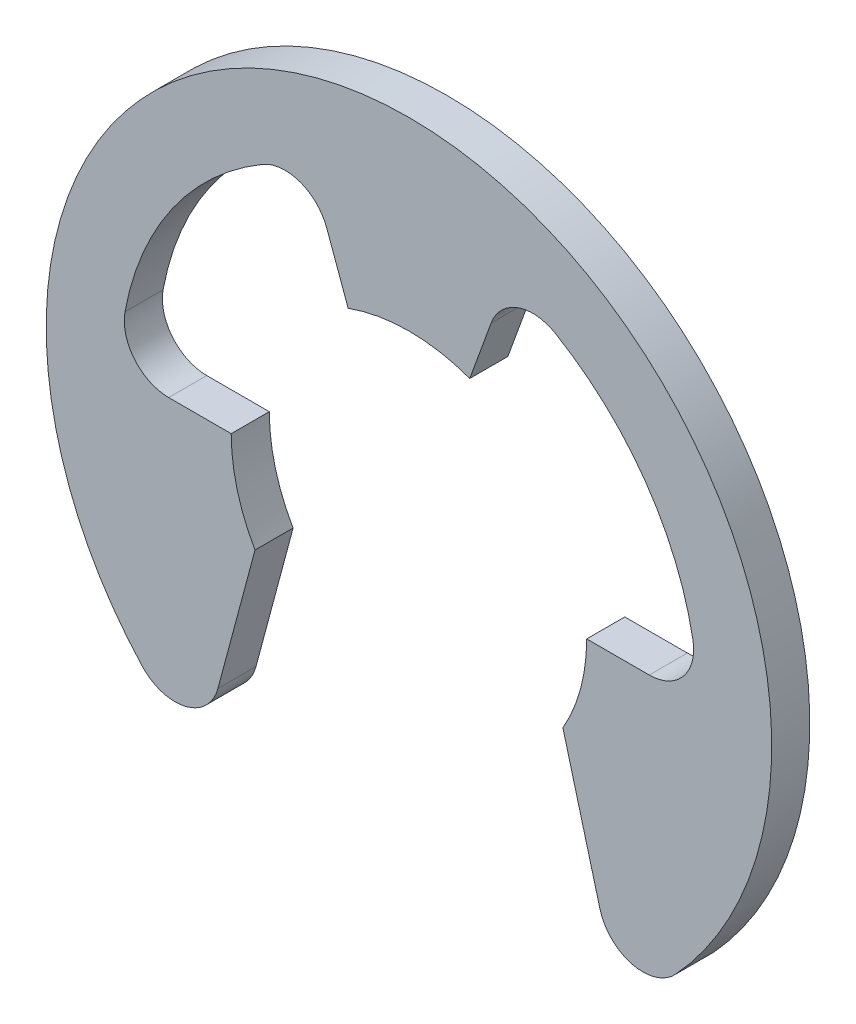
ISO-10303-21;
HEADER;
FILE_DESCRIPTION(('STEP AP214'),'2;1');
FILE_NAME('part.step','',(''),(''),'','','');
FILE_SCHEMA(('AUTOMOTIVE_DESIGN { 1 0 10303 214 1 1 1 1 }'));
ENDSEC;
DATA;
#1=APPLICATION_CONTEXT('core data for automotive mechanical design processes');
#2=APPLICATION_PROTOCOL_DEFINITION('international standard','automotive_design',2000,#1);
#3=PRODUCT_CONTEXT('',#1,'mechanical');
#4=PRODUCT('Part','Part','',(#3));
#5=PRODUCT_RELATED_PRODUCT_CATEGORY('part','',(#4));
#6=PRODUCT_DEFINITION_FORMATION('','',#4);
#7=PRODUCT_DEFINITION_CONTEXT('part definition',#1,'design');
#8=PRODUCT_DEFINITION('design','',#6,#7);
#9=PRODUCT_DEFINITION_SHAPE('','',#8);
#10=(LENGTH_UNIT() NAMED_UNIT(*) SI_UNIT(.MILLI.,.METRE.));
#11=(NAMED_UNIT(*) PLANE_ANGLE_UNIT() SI_UNIT($,.RADIAN.));
#12=(NAMED_UNIT(*) SI_UNIT($,.STERADIAN.) SOLID_ANGLE_UNIT());
#13=UNCERTAINTY_MEASURE_WITH_UNIT(LENGTH_MEASURE(1.E-05),#10,'distance_accuracy_value','');
#14=(GEOMETRIC_REPRESENTATION_CONTEXT(3) GLOBAL_UNCERTAINTY_ASSIGNED_CONTEXT((#13)) GLOBAL_UNIT_ASSIGNED_CONTEXT((#10,
#11,#12)) REPRESENTATION_CONTEXT('',''));
#15=CARTESIAN_POINT('',(0.,0.,0.));
#16=DIRECTION('',(0.,0.,1.));
#17=DIRECTION('',(1.,0.,0.));
#18=AXIS2_PLACEMENT_3D('',#15,#16,#17);
#19=CARTESIAN_POINT('',(0.,0.,-1.0668));
#20=DIRECTION('',(0.,0.,1.));
#21=DIRECTION('',(1.,0.,0.));
#22=AXIS2_PLACEMENT_3D('',#19,#20,#21);
#23=CYLINDRICAL_SURFACE('',#22,4.9784);
#24=CARTESIAN_POINT('',(0.,0.,0.));
#25=DIRECTION('',(0.,0.,-1.));
#26=DIRECTION('',(1.,0.,0.));
#27=AXIS2_PLACEMENT_3D('',#24,#25,#26);
#28=CIRCLE('',#27,4.9784);
#29=CARTESIAN_POINT('',(4.9784,0.,0.));
#30=VERTEX_POINT('',#29);
#31=CARTESIAN_POINT('',(4.31142087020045,-2.48920000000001,0.));
#32=VERTEX_POINT('',#31);
#33=EDGE_CURVE('E198',#30,#32,#28,.T.);
#34=ORIENTED_EDGE('',*,*,#33,.F.);
#35=DIRECTION('',(0.,0.,1.));
#36=VECTOR('',#35,1.);
#37=CARTESIAN_POINT('',(4.9784,0.,-1.0668));
#38=LINE('',#37,#36);
#39=CARTESIAN_POINT('',(4.9784,0.,-1.0668));
#40=VERTEX_POINT('',#39);
#41=EDGE_CURVE('E11',#40,#30,#38,.T.);
#42=ORIENTED_EDGE('',*,*,#41,.F.);
#43=CARTESIAN_POINT('',(0.,0.,-1.0668));
#44=DIRECTION('',(0.,0.,-1.));
#45=DIRECTION('',(1.,0.,0.));
#46=AXIS2_PLACEMENT_3D('',#43,#44,#45);
#47=CIRCLE('',#46,4.9784);
#48=CARTESIAN_POINT('',(4.31142087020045,-2.48920000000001,-1.0668));
#49=VERTEX_POINT('',#48);
#50=EDGE_CURVE('E246',#40,#49,#47,.T.);
#51=ORIENTED_EDGE('',*,*,#50,.T.);
#52=DIRECTION('',(0.,0.,1.));
#53=VECTOR('',#52,1.);
#54=CARTESIAN_POINT('',(4.31142087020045,-2.48920000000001,-1.0668));
#55=LINE('',#54,#53);
#56=EDGE_CURVE('E45',#49,#32,#55,.T.);
#57=ORIENTED_EDGE('',*,*,#56,.T.);
#58=EDGE_LOOP('',(#34,#42,#51,#57));
#59=FACE_BOUND('',#58,.T.);
#60=ADVANCED_FACE('F39',(#59),#23,.F.);
#61=CARTESIAN_POINT('',(4.9784,0.,-1.0668));
#62=DIRECTION('',(0.,1.,0.));
#63=DIRECTION('',(-1.,0.,0.));
#64=AXIS2_PLACEMENT_3D('',#61,#62,#63);
#65=PLANE('',#64);
#66=DIRECTION('',(-1.,0.,0.));
#67=VECTOR('',#66,1.);
#68=CARTESIAN_POINT('',(4.9784,0.,0.));
#69=LINE('',#68,#67);
#70=CARTESIAN_POINT('',(6.7298416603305,0.,0.));
#71=VERTEX_POINT('',#70);
#72=EDGE_CURVE('E242',#71,#30,#69,.T.);
#73=ORIENTED_EDGE('',*,*,#72,.F.);
#74=DIRECTION('',(0.,0.,1.));
#75=VECTOR('',#74,1.);
#76=CARTESIAN_POINT('',(6.7298416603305,0.,-1.0668));
#77=LINE('',#76,#75);
#78=CARTESIAN_POINT('',(6.7298416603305,0.,-1.0668));
#79=VERTEX_POINT('',#78);
#80=EDGE_CURVE('E48',#79,#71,#77,.T.);
#81=ORIENTED_EDGE('',*,*,#80,.F.);
#82=DIRECTION('',(-1.,0.,0.));
#83=VECTOR('',#82,1.);
#84=CARTESIAN_POINT('',(4.9784,0.,-1.0668));
#85=LINE('',#84,#83);
#86=EDGE_CURVE('E187',#79,#40,#85,.T.);
#87=ORIENTED_EDGE('',*,*,#86,.T.);
#88=ORIENTED_EDGE('',*,*,#41,.T.);
#89=EDGE_LOOP('',(#73,#81,#87,#88));
#90=FACE_BOUND('',#89,.T.);
#91=ADVANCED_FACE('F279',(#90),#65,.T.);
#92=CARTESIAN_POINT('',(6.7298416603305,1.243584,-1.0668));
#93=DIRECTION('',(0.,0.,1.));
#94=DIRECTION('',(1.,0.,0.));
#95=AXIS2_PLACEMENT_3D('',#92,#93,#94);
#96=CYLINDRICAL_SURFACE('',#95,1.243584);
#97=CARTESIAN_POINT('',(6.7298416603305,1.243584,0.));
#98=DIRECTION('',(0.,0.,-1.));
#99=DIRECTION('',(1.,0.,0.));
#100=AXIS2_PLACEMENT_3D('',#97,#98,#99);
#101=CIRCLE('',#100,1.243584);
#102=CARTESIAN_POINT('',(7.95272262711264,1.46955591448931,0.));
#103=VERTEX_POINT('',#102);
#104=EDGE_CURVE('E173',#103,#71,#101,.T.);
#105=ORIENTED_EDGE('',*,*,#104,.F.);
#106=DIRECTION('',(0.,0.,1.));
#107=VECTOR('',#106,1.);
#108=CARTESIAN_POINT('',(7.95272262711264,1.46955591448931,-1.0668));
#109=LINE('',#108,#107);
#110=CARTESIAN_POINT('',(7.95272262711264,1.46955591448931,-1.0668));
#111=VERTEX_POINT('',#110);
#112=EDGE_CURVE('E166',#111,#103,#109,.T.);
#113=ORIENTED_EDGE('',*,*,#112,.F.);
#114=CARTESIAN_POINT('',(6.7298416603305,1.243584,-1.0668));
#115=DIRECTION('',(0.,0.,-1.));
#116=DIRECTION('',(1.,0.,0.));
#117=AXIS2_PLACEMENT_3D('',#114,#115,#116);
#118=CIRCLE('',#117,1.243584);
#119=EDGE_CURVE('E171',#111,#79,#118,.T.);
#120=ORIENTED_EDGE('',*,*,#119,.T.);
#121=ORIENTED_EDGE('',*,*,#80,.T.);
#122=EDGE_LOOP('',(#105,#113,#120,#121));
#123=FACE_BOUND('',#122,.T.);
#124=ADVANCED_FACE('F167',(#123),#96,.F.);
#125=CARTESIAN_POINT('',(0.,0.,-1.0668));
#126=DIRECTION('',(0.,0.,1.));
#127=DIRECTION('',(1.,0.,0.));
#128=AXIS2_PLACEMENT_3D('',#125,#126,#127);
#129=CYLINDRICAL_SURFACE('',#128,8.08736);
#130=CARTESIAN_POINT('',(0.,0.,0.));
#131=DIRECTION('',(0.,0.,-1.));
#132=DIRECTION('',(1.,0.,0.));
#133=AXIS2_PLACEMENT_3D('',#130,#131,#132);
#134=CIRCLE('',#133,8.08736);
#135=CARTESIAN_POINT('',(4.10092218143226,6.97049704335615,0.));
#136=VERTEX_POINT('',#135);
#137=EDGE_CURVE('E241',#136,#103,#134,.T.);
#138=ORIENTED_EDGE('',*,*,#137,.F.);
#139=DIRECTION('',(0.,0.,1.));
#140=VECTOR('',#139,1.);
#141=CARTESIAN_POINT('',(4.10092218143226,6.97049704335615,-1.0668));
#142=LINE('',#141,#140);
#143=CARTESIAN_POINT('',(4.10092218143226,6.97049704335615,-1.0668));
#144=VERTEX_POINT('',#143);
#145=EDGE_CURVE('E178',#144,#136,#142,.T.);
#146=ORIENTED_EDGE('',*,*,#145,.F.);
#147=CARTESIAN_POINT('',(0.,0.,-1.0668));
#148=DIRECTION('',(0.,0.,-1.));
#149=DIRECTION('',(1.,0.,0.));
#150=AXIS2_PLACEMENT_3D('',#147,#148,#149);
#151=CIRCLE('',#150,8.08736);
#152=EDGE_CURVE('E183',#144,#111,#151,.T.);
#153=ORIENTED_EDGE('',*,*,#152,.T.);
#154=ORIENTED_EDGE('',*,*,#112,.T.);
#155=EDGE_LOOP('',(#138,#146,#153,#154));
#156=FACE_BOUND('',#155,.T.);
#157=ADVANCED_FACE('F189',(#156),#129,.F.);
#158=CARTESIAN_POINT('',(3.47032811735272,5.89865176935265,-1.0668));
#159=DIRECTION('',(0.,0.,1.));
#160=DIRECTION('',(1.,0.,0.));
#161=AXIS2_PLACEMENT_3D('',#158,#159,#160);
#162=CYLINDRICAL_SURFACE('',#161,1.243584);
#163=CARTESIAN_POINT('',(3.47032811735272,5.89865176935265,0.));
#164=DIRECTION('',(0.,0.,-1.));
#165=DIRECTION('',(-1.,0.,0.));
#166=AXIS2_PLACEMENT_3D('',#163,#164,#165);
#167=CIRCLE('',#166,1.243584);
#168=CARTESIAN_POINT('',(2.3017414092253,6.32398254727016,0.));
#169=VERTEX_POINT('',#168);
#170=EDGE_CURVE('E238',#169,#136,#167,.T.);
#171=ORIENTED_EDGE('',*,*,#170,.F.);
#172=DIRECTION('',(0.,0.,1.));
#173=VECTOR('',#172,1.);
#174=CARTESIAN_POINT('',(2.3017414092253,6.32398254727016,-1.0668));
#175=LINE('',#174,#173);
#176=CARTESIAN_POINT('',(2.3017414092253,6.32398254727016,-1.0668));
#177=VERTEX_POINT('',#176);
#178=EDGE_CURVE('E249',#177,#169,#175,.T.);
#179=ORIENTED_EDGE('',*,*,#178,.F.);
#180=CARTESIAN_POINT('',(3.47032811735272,5.89865176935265,-1.0668));
#181=DIRECTION('',(0.,0.,-1.));
#182=DIRECTION('',(-1.,0.,0.));
#183=AXIS2_PLACEMENT_3D('',#180,#181,#182);
#184=CIRCLE('',#183,1.243584);
#185=EDGE_CURVE('E186',#177,#144,#184,.T.);
#186=ORIENTED_EDGE('',*,*,#185,.T.);
#187=ORIENTED_EDGE('',*,*,#145,.T.);
#188=EDGE_LOOP('',(#171,#179,#186,#187));
#189=FACE_BOUND('',#188,.T.);
#190=ADVANCED_FACE('F293',(#189),#162,.F.);
#191=CARTESIAN_POINT('',(1.70271308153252,4.67816574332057,-1.0668));
#192=DIRECTION('',(0.939692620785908,-0.34202014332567,0.));
#193=DIRECTION('',(0.34202014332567,0.939692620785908,0.));
#194=AXIS2_PLACEMENT_3D('',#191,#192,#193);
#195=PLANE('',#194);
#196=DIRECTION('',(0.34202014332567,0.939692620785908,0.));
#197=VECTOR('',#196,1.);
#198=CARTESIAN_POINT('',(1.70271308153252,4.67816574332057,0.));
#199=LINE('',#198,#197);
#200=CARTESIAN_POINT('',(1.70271308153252,4.67816574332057,0.));
#201=VERTEX_POINT('',#200);
#202=EDGE_CURVE('E232',#201,#169,#199,.T.);
#203=ORIENTED_EDGE('',*,*,#202,.F.);
#204=DIRECTION('',(0.,0.,1.));
#205=VECTOR('',#204,1.);
#206=CARTESIAN_POINT('',(1.70271308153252,4.67816574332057,-1.0668));
#207=LINE('',#206,#205);
#208=CARTESIAN_POINT('',(1.70271308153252,4.67816574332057,-1.0668));
#209=VERTEX_POINT('',#208);
#210=EDGE_CURVE('E255',#209,#201,#207,.T.);
#211=ORIENTED_EDGE('',*,*,#210,.F.);
#212=DIRECTION('',(0.34202014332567,0.939692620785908,0.));
#213=VECTOR('',#212,1.);
#214=CARTESIAN_POINT('',(1.70271308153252,4.67816574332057,-1.0668));
#215=LINE('',#214,#213);
#216=EDGE_CURVE('E192',#209,#177,#215,.T.);
#217=ORIENTED_EDGE('',*,*,#216,.T.);
#218=ORIENTED_EDGE('',*,*,#178,.T.);
#219=EDGE_LOOP('',(#203,#211,#217,#218));
#220=FACE_BOUND('',#219,.T.);
#221=ADVANCED_FACE('F295',(#220),#195,.T.);
#222=CARTESIAN_POINT('',(0.,0.,-1.0668));
#223=DIRECTION('',(0.,0.,1.));
#224=DIRECTION('',(1.,0.,0.));
#225=AXIS2_PLACEMENT_3D('',#222,#223,#224);
#226=CYLINDRICAL_SURFACE('',#225,4.9784);
#227=CARTESIAN_POINT('',(0.,0.,0.));
#228=DIRECTION('',(0.,0.,-1.));
#229=DIRECTION('',(1.,0.,0.));
#230=AXIS2_PLACEMENT_3D('',#227,#228,#229);
#231=CIRCLE('',#230,4.9784);
#232=CARTESIAN_POINT('',(-1.70271308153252,4.67816574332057,0.));
#233=VERTEX_POINT('',#232);
#234=EDGE_CURVE('E235',#233,#201,#231,.T.);
#235=ORIENTED_EDGE('',*,*,#234,.F.);
#236=DIRECTION('',(0.,0.,1.));
#237=VECTOR('',#236,1.);
#238=CARTESIAN_POINT('',(-1.70271308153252,4.67816574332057,-1.0668));
#239=LINE('',#238,#237);
#240=CARTESIAN_POINT('',(-1.70271308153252,4.67816574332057,-1.0668));
#241=VERTEX_POINT('',#240);
#242=EDGE_CURVE('E251',#241,#233,#239,.T.);
#243=ORIENTED_EDGE('',*,*,#242,.F.);
#244=CARTESIAN_POINT('',(0.,0.,-1.0668));
#245=DIRECTION('',(0.,0.,-1.));
#246=DIRECTION('',(1.,0.,0.));
#247=AXIS2_PLACEMENT_3D('',#244,#245,#246);
#248=CIRCLE('',#247,4.9784);
#249=EDGE_CURVE('E505',#241,#209,#248,.T.);
#250=ORIENTED_EDGE('',*,*,#249,.T.);
#251=ORIENTED_EDGE('',*,*,#210,.T.);
#252=EDGE_LOOP('',(#235,#243,#250,#251));
#253=FACE_BOUND('',#252,.T.);
#254=ADVANCED_FACE('F296',(#253),#226,.F.);
#255=CARTESIAN_POINT('',(-1.70271308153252,4.67816574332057,-1.0668));
#256=DIRECTION('',(-0.939692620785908,-0.34202014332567,0.));
#257=DIRECTION('',(0.34202014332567,-0.939692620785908,0.));
#258=AXIS2_PLACEMENT_3D('',#255,#256,#257);
#259=PLANE('',#258);
#260=DIRECTION('',(0.34202014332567,-0.939692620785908,0.));
#261=VECTOR('',#260,1.);
#262=CARTESIAN_POINT('',(-1.70271308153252,4.67816574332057,0.));
#263=LINE('',#262,#261);
#264=CARTESIAN_POINT('',(-2.3017414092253,6.32398254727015,0.));
#265=VERTEX_POINT('',#264);
#266=EDGE_CURVE('E230',#265,#233,#263,.T.);
#267=ORIENTED_EDGE('',*,*,#266,.F.);
#268=DIRECTION('',(0.,0.,1.));
#269=VECTOR('',#268,1.);
#270=CARTESIAN_POINT('',(-2.3017414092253,6.32398254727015,-1.0668));
#271=LINE('',#270,#269);
#272=CARTESIAN_POINT('',(-2.3017414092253,6.32398254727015,-1.0668));
#273=VERTEX_POINT('',#272);
#274=EDGE_CURVE('E257',#273,#265,#271,.T.);
#275=ORIENTED_EDGE('',*,*,#274,.F.);
#276=DIRECTION('',(0.34202014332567,-0.939692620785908,0.));
#277=VECTOR('',#276,1.);
#278=CARTESIAN_POINT('',(-1.70271308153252,4.67816574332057,-1.0668));
#279=LINE('',#278,#277);
#280=EDGE_CURVE('E506',#273,#241,#279,.T.);
#281=ORIENTED_EDGE('',*,*,#280,.T.);
#282=ORIENTED_EDGE('',*,*,#242,.T.);
#283=EDGE_LOOP('',(#267,#275,#281,#282));
#284=FACE_BOUND('',#283,.T.);
#285=ADVANCED_FACE('F305',(#284),#259,.T.);
#286=CARTESIAN_POINT('',(-3.47032811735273,5.89865176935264,-1.0668));
#287=DIRECTION('',(0.,0.,1.));
#288=DIRECTION('',(1.,0.,0.));
#289=AXIS2_PLACEMENT_3D('',#286,#287,#288);
#290=CYLINDRICAL_SURFACE('',#289,1.243584);
#291=CARTESIAN_POINT('',(-3.47032811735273,5.89865176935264,0.));
#292=DIRECTION('',(0.,0.,-1.));
#293=DIRECTION('',(1.,0.,0.));
#294=AXIS2_PLACEMENT_3D('',#291,#292,#293);
#295=CIRCLE('',#294,1.243584);
#296=CARTESIAN_POINT('',(-4.10092218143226,6.97049704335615,0.));
#297=VERTEX_POINT('',#296);
#298=EDGE_CURVE('E228',#297,#265,#295,.T.);
#299=ORIENTED_EDGE('',*,*,#298,.F.);
#300=DIRECTION('',(0.,0.,1.));
#301=VECTOR('',#300,1.);
#302=CARTESIAN_POINT('',(-4.10092218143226,6.97049704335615,-1.0668));
#303=LINE('',#302,#301);
#304=CARTESIAN_POINT('',(-4.10092218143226,6.97049704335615,-1.0668));
#305=VERTEX_POINT('',#304);
#306=EDGE_CURVE('E259',#305,#297,#303,.T.);
#307=ORIENTED_EDGE('',*,*,#306,.F.);
#308=CARTESIAN_POINT('',(-3.47032811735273,5.89865176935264,-1.0668));
#309=DIRECTION('',(0.,0.,-1.));
#310=DIRECTION('',(1.,0.,0.));
#311=AXIS2_PLACEMENT_3D('',#308,#309,#310);
#312=CIRCLE('',#311,1.243584);
#313=EDGE_CURVE('E492',#305,#273,#312,.T.);
#314=ORIENTED_EDGE('',*,*,#313,.T.);
#315=ORIENTED_EDGE('',*,*,#274,.T.);
#316=EDGE_LOOP('',(#299,#307,#314,#315));
#317=FACE_BOUND('',#316,.T.);
#318=ADVANCED_FACE('F306',(#317),#290,.F.);
#319=CARTESIAN_POINT('',(0.,0.,-1.0668));
#320=DIRECTION('',(0.,0.,1.));
#321=DIRECTION('',(1.,0.,0.));
#322=AXIS2_PLACEMENT_3D('',#319,#320,#321);
#323=CYLINDRICAL_SURFACE('',#322,8.08736);
#324=CARTESIAN_POINT('',(0.,0.,0.));
#325=DIRECTION('',(0.,0.,-1.));
#326=DIRECTION('',(1.,0.,0.));
#327=AXIS2_PLACEMENT_3D('',#324,#325,#326);
#328=CIRCLE('',#327,8.08736);
#329=CARTESIAN_POINT('',(-7.95272262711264,1.46955591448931,0.));
#330=VERTEX_POINT('',#329);
#331=EDGE_CURVE('E221',#330,#297,#328,.T.);
#332=ORIENTED_EDGE('',*,*,#331,.F.);
#333=DIRECTION('',(0.,0.,1.));
#334=VECTOR('',#333,1.);
#335=CARTESIAN_POINT('',(-7.95272262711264,1.46955591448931,-1.0668));
#336=LINE('',#335,#334);
#337=CARTESIAN_POINT('',(-7.95272262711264,1.46955591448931,-1.0668));
#338=VERTEX_POINT('',#337);
#339=EDGE_CURVE('E258',#338,#330,#336,.T.);
#340=ORIENTED_EDGE('',*,*,#339,.F.);
#341=CARTESIAN_POINT('',(0.,0.,-1.0668));
#342=DIRECTION('',(0.,0.,-1.));
#343=DIRECTION('',(1.,0.,0.));
#344=AXIS2_PLACEMENT_3D('',#341,#342,#343);
#345=CIRCLE('',#344,8.08736);
#346=EDGE_CURVE('E493',#338,#305,#345,.T.);
#347=ORIENTED_EDGE('',*,*,#346,.T.);
#348=ORIENTED_EDGE('',*,*,#306,.T.);
#349=EDGE_LOOP('',(#332,#340,#347,#348));
#350=FACE_BOUND('',#349,.T.);
#351=ADVANCED_FACE('F309',(#350),#323,.F.);
#352=CARTESIAN_POINT('',(-6.7298416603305,1.243584,-1.0668));
#353=DIRECTION('',(0.,0.,1.));
#354=DIRECTION('',(1.,0.,0.));
#355=AXIS2_PLACEMENT_3D('',#352,#353,#354);
#356=CYLINDRICAL_SURFACE('',#355,1.243584);
#357=CARTESIAN_POINT('',(-6.7298416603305,1.243584,0.));
#358=DIRECTION('',(0.,0.,-1.));
#359=DIRECTION('',(-1.,0.,0.));
#360=AXIS2_PLACEMENT_3D('',#357,#358,#359);
#361=CIRCLE('',#360,1.243584);
#362=CARTESIAN_POINT('',(-6.7298416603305,0.,0.));
#363=VERTEX_POINT('',#362);
#364=EDGE_CURVE('E216',#363,#330,#361,.T.);
#365=ORIENTED_EDGE('',*,*,#364,.F.);
#366=DIRECTION('',(0.,0.,1.));
#367=VECTOR('',#366,1.);
#368=CARTESIAN_POINT('',(-6.7298416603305,0.,-1.0668));
#369=LINE('',#368,#367);
#370=CARTESIAN_POINT('',(-6.7298416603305,0.,-1.0668));
#371=VERTEX_POINT('',#370);
#372=EDGE_CURVE('E264',#371,#363,#369,.T.);
#373=ORIENTED_EDGE('',*,*,#372,.F.);
#374=CARTESIAN_POINT('',(-6.7298416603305,1.243584,-1.0668));
#375=DIRECTION('',(0.,0.,-1.));
#376=DIRECTION('',(-1.,0.,0.));
#377=AXIS2_PLACEMENT_3D('',#374,#375,#376);
#378=CIRCLE('',#377,1.243584);
#379=EDGE_CURVE('E515',#371,#338,#378,.T.);
#380=ORIENTED_EDGE('',*,*,#379,.T.);
#381=ORIENTED_EDGE('',*,*,#339,.T.);
#382=EDGE_LOOP('',(#365,#373,#380,#381));
#383=FACE_BOUND('',#382,.T.);
#384=ADVANCED_FACE('F313',(#383),#356,.F.);
#385=CARTESIAN_POINT('',(-4.9784,0.,-1.0668));
#386=DIRECTION('',(0.,1.,0.));
#387=DIRECTION('',(-1.,0.,0.));
#388=AXIS2_PLACEMENT_3D('',#385,#386,#387);
#389=PLANE('',#388);
#390=DIRECTION('',(-1.,0.,0.));
#391=VECTOR('',#390,1.);
#392=CARTESIAN_POINT('',(-4.9784,0.,0.));
#393=LINE('',#392,#391);
#394=CARTESIAN_POINT('',(-4.9784,0.,0.));
#395=VERTEX_POINT('',#394);
#396=EDGE_CURVE('E219',#395,#363,#393,.T.);
#397=ORIENTED_EDGE('',*,*,#396,.F.);
#398=DIRECTION('',(0.,0.,1.));
#399=VECTOR('',#398,1.);
#400=CARTESIAN_POINT('',(-4.9784,0.,-1.0668));
#401=LINE('',#400,#399);
#402=CARTESIAN_POINT('',(-4.9784,0.,-1.0668));
#403=VERTEX_POINT('',#402);
#404=EDGE_CURVE('E265',#403,#395,#401,.T.);
#405=ORIENTED_EDGE('',*,*,#404,.F.);
#406=DIRECTION('',(-1.,0.,0.));
#407=VECTOR('',#406,1.);
#408=CARTESIAN_POINT('',(-4.9784,0.,-1.0668));
#409=LINE('',#408,#407);
#410=EDGE_CURVE('E484',#403,#371,#409,.T.);
#411=ORIENTED_EDGE('',*,*,#410,.T.);
#412=ORIENTED_EDGE('',*,*,#372,.T.);
#413=EDGE_LOOP('',(#397,#405,#411,#412));
#414=FACE_BOUND('',#413,.T.);
#415=ADVANCED_FACE('F319',(#414),#389,.T.);
#416=CARTESIAN_POINT('',(0.,0.,-1.0668));
#417=DIRECTION('',(0.,0.,1.));
#418=DIRECTION('',(1.,0.,0.));
#419=AXIS2_PLACEMENT_3D('',#416,#417,#418);
#420=CYLINDRICAL_SURFACE('',#419,4.9784);
#421=CARTESIAN_POINT('',(0.,0.,0.));
#422=DIRECTION('',(0.,0.,-1.));
#423=DIRECTION('',(1.,0.,0.));
#424=AXIS2_PLACEMENT_3D('',#421,#422,#423);
#425=CIRCLE('',#424,4.9784);
#426=CARTESIAN_POINT('',(-4.31142087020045,-2.4892,0.));
#427=VERTEX_POINT('',#426);
#428=EDGE_CURVE('E211',#427,#395,#425,.T.);
#429=ORIENTED_EDGE('',*,*,#428,.F.);
#430=DIRECTION('',(0.,0.,1.));
#431=VECTOR('',#430,1.);
#432=CARTESIAN_POINT('',(-4.31142087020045,-2.4892,-1.0668));
#433=LINE('',#432,#431);
#434=CARTESIAN_POINT('',(-4.31142087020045,-2.4892,-1.0668));
#435=VERTEX_POINT('',#434);
#436=EDGE_CURVE('E268',#435,#427,#433,.T.);
#437=ORIENTED_EDGE('',*,*,#436,.F.);
#438=CARTESIAN_POINT('',(0.,0.,-1.0668));
#439=DIRECTION('',(0.,0.,-1.));
#440=DIRECTION('',(1.,0.,0.));
#441=AXIS2_PLACEMENT_3D('',#438,#439,#440);
#442=CIRCLE('',#441,4.9784);
#443=EDGE_CURVE('E476',#435,#403,#442,.T.);
#444=ORIENTED_EDGE('',*,*,#443,.T.);
#445=ORIENTED_EDGE('',*,*,#404,.T.);
#446=EDGE_LOOP('',(#429,#437,#444,#445));
#447=FACE_BOUND('',#446,.T.);
#448=ADVANCED_FACE('F325',(#447),#420,.F.);
#449=CARTESIAN_POINT('',(-4.31142087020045,-2.48920000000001,-1.0668));
#450=DIRECTION('',(0.965925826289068,-0.258819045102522,0.));
#451=DIRECTION('',(0.258819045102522,0.965925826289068,0.));
#452=AXIS2_PLACEMENT_3D('',#449,#450,#451);
#453=PLANE('',#452);
#454=DIRECTION('',(0.258819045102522,0.965925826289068,0.));
#455=VECTOR('',#454,1.);
#456=CARTESIAN_POINT('',(-4.31142087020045,-2.48920000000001,0.));
#457=LINE('',#456,#455);
#458=CARTESIAN_POINT('',(-5.3510620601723,-6.36919374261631,0.));
#459=VERTEX_POINT('',#458);
#460=EDGE_CURVE('E212',#459,#427,#457,.T.);
#461=ORIENTED_EDGE('',*,*,#460,.F.);
#462=DIRECTION('',(0.,0.,1.));
#463=VECTOR('',#462,1.);
#464=CARTESIAN_POINT('',(-5.3510620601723,-6.36919374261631,-1.0668));
#465=LINE('',#464,#463);
#466=CARTESIAN_POINT('',(-5.3510620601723,-6.36919374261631,-1.0668));
#467=VERTEX_POINT('',#466);
#468=EDGE_CURVE('E266',#467,#459,#465,.T.);
#469=ORIENTED_EDGE('',*,*,#468,.F.);
#470=DIRECTION('',(0.258819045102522,0.965925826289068,0.));
#471=VECTOR('',#470,1.);
#472=CARTESIAN_POINT('',(-4.31142087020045,-2.48920000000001,-1.0668));
#473=LINE('',#472,#471);
#474=EDGE_CURVE('E517',#467,#435,#473,.T.);
#475=ORIENTED_EDGE('',*,*,#474,.T.);
#476=ORIENTED_EDGE('',*,*,#436,.T.);
#477=EDGE_LOOP('',(#461,#469,#475,#476));
#478=FACE_BOUND('',#477,.T.);
#479=ADVANCED_FACE('F328',(#478),#453,.T.);
#480=CARTESIAN_POINT('',(-6.55227196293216,-6.04733051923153,-1.0668));
#481=DIRECTION('',(0.,0.,1.));
#482=DIRECTION('',(1.,0.,0.));
#483=AXIS2_PLACEMENT_3D('',#480,#481,#482);
#484=CYLINDRICAL_SURFACE('',#483,1.243584);
#485=CARTESIAN_POINT('',(-6.55227196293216,-6.04733051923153,0.));
#486=DIRECTION('',(0.,0.,1.));
#487=DIRECTION('',(-1.,0.,0.));
#488=AXIS2_PLACEMENT_3D('',#485,#486,#487);
#489=CIRCLE('',#488,1.243584);
#490=CARTESIAN_POINT('',(-7.46612575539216,-6.89075947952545,0.));
#491=VERTEX_POINT('',#490);
#492=EDGE_CURVE('E206',#491,#459,#489,.T.);
#493=ORIENTED_EDGE('',*,*,#492,.F.);
#494=DIRECTION('',(0.,0.,1.));
#495=VECTOR('',#494,1.);
#496=CARTESIAN_POINT('',(-7.46612575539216,-6.89075947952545,-1.0668));
#497=LINE('',#496,#495);
#498=CARTESIAN_POINT('',(-7.46612575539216,-6.89075947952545,-1.0668));
#499=VERTEX_POINT('',#498);
#500=EDGE_CURVE('E267',#499,#491,#497,.T.);
#501=ORIENTED_EDGE('',*,*,#500,.F.);
#502=CARTESIAN_POINT('',(-6.55227196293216,-6.04733051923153,-1.0668));
#503=DIRECTION('',(0.,0.,1.));
#504=DIRECTION('',(-1.,0.,0.));
#505=AXIS2_PLACEMENT_3D('',#502,#503,#504);
#506=CIRCLE('',#505,1.243584);
#507=EDGE_CURVE('E474',#499,#467,#506,.T.);
#508=ORIENTED_EDGE('',*,*,#507,.T.);
#509=ORIENTED_EDGE('',*,*,#468,.T.);
#510=EDGE_LOOP('',(#493,#501,#508,#509));
#511=FACE_BOUND('',#510,.T.);
#512=ADVANCED_FACE('F326',(#511),#484,.T.);
#513=CARTESIAN_POINT('',(0.,0.,-1.0668));
#514=DIRECTION('',(0.,0.,1.));
#515=DIRECTION('',(1.,0.,0.));
#516=AXIS2_PLACEMENT_3D('',#513,#514,#515);
#517=CYLINDRICAL_SURFACE('',#516,10.16);
#518=CARTESIAN_POINT('',(0.,0.,0.));
#519=DIRECTION('',(0.,0.,1.));
#520=DIRECTION('',(1.,0.,0.));
#521=AXIS2_PLACEMENT_3D('',#518,#519,#520);
#522=CIRCLE('',#521,10.16);
#523=CARTESIAN_POINT('',(7.46612575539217,-6.89075947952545,0.));
#524=VERTEX_POINT('',#523);
#525=EDGE_CURVE('E202',#524,#491,#522,.T.);
#526=ORIENTED_EDGE('',*,*,#525,.F.);
#527=DIRECTION('',(0.,0.,1.));
#528=VECTOR('',#527,1.);
#529=CARTESIAN_POINT('',(7.46612575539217,-6.89075947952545,-1.0668));
#530=LINE('',#529,#528);
#531=CARTESIAN_POINT('',(7.46612575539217,-6.89075947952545,-1.0668));
#532=VERTEX_POINT('',#531);
#533=EDGE_CURVE('E275',#532,#524,#530,.T.);
#534=ORIENTED_EDGE('',*,*,#533,.F.);
#535=CARTESIAN_POINT('',(0.,0.,-1.0668));
#536=DIRECTION('',(0.,0.,1.));
#537=DIRECTION('',(1.,0.,0.));
#538=AXIS2_PLACEMENT_3D('',#535,#536,#537);
#539=CIRCLE('',#538,10.16);
#540=EDGE_CURVE('E469',#532,#499,#539,.T.);
#541=ORIENTED_EDGE('',*,*,#540,.T.);
#542=ORIENTED_EDGE('',*,*,#500,.T.);
#543=EDGE_LOOP('',(#526,#534,#541,#542));
#544=FACE_BOUND('',#543,.T.);
#545=ADVANCED_FACE('F334',(#544),#517,.T.);
#546=CARTESIAN_POINT('',(6.55227196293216,-6.04733051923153,-1.0668));
#547=DIRECTION('',(0.,0.,1.));
#548=DIRECTION('',(1.,0.,0.));
#549=AXIS2_PLACEMENT_3D('',#546,#547,#548);
#550=CYLINDRICAL_SURFACE('',#549,1.243584);
#551=CARTESIAN_POINT('',(6.55227196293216,-6.04733051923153,0.));
#552=DIRECTION('',(0.,0.,1.));
#553=DIRECTION('',(1.,0.,0.));
#554=AXIS2_PLACEMENT_3D('',#551,#552,#553);
#555=CIRCLE('',#554,1.243584);
#556=CARTESIAN_POINT('',(5.3510620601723,-6.3691937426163,0.));
#557=VERTEX_POINT('',#556);
#558=EDGE_CURVE('E205',#557,#524,#555,.T.);
#559=ORIENTED_EDGE('',*,*,#558,.F.);
#560=DIRECTION('',(0.,0.,1.));
#561=VECTOR('',#560,1.);
#562=CARTESIAN_POINT('',(5.3510620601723,-6.3691937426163,-1.0668));
#563=LINE('',#562,#561);
#564=CARTESIAN_POINT('',(5.3510620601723,-6.3691937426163,-1.0668));
#565=VERTEX_POINT('',#564);
#566=EDGE_CURVE('E271',#565,#557,#563,.T.);
#567=ORIENTED_EDGE('',*,*,#566,.F.);
#568=CARTESIAN_POINT('',(6.55227196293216,-6.04733051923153,-1.0668));
#569=DIRECTION('',(0.,0.,1.));
#570=DIRECTION('',(1.,0.,0.));
#571=AXIS2_PLACEMENT_3D('',#568,#569,#570);
#572=CIRCLE('',#571,1.243584);
#573=EDGE_CURVE('E518',#565,#532,#572,.T.);
#574=ORIENTED_EDGE('',*,*,#573,.T.);
#575=ORIENTED_EDGE('',*,*,#533,.T.);
#576=EDGE_LOOP('',(#559,#567,#574,#575));
#577=FACE_BOUND('',#576,.T.);
#578=ADVANCED_FACE('F336',(#577),#550,.T.);
#579=CARTESIAN_POINT('',(4.31142087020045,-2.48920000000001,-1.0668));
#580=DIRECTION('',(-0.965925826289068,-0.258819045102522,0.));
#581=DIRECTION('',(0.258819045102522,-0.965925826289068,0.));
#582=AXIS2_PLACEMENT_3D('',#579,#580,#581);
#583=PLANE('',#582);
#584=DIRECTION('',(0.258819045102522,-0.965925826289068,0.));
#585=VECTOR('',#584,1.);
#586=CARTESIAN_POINT('',(4.31142087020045,-2.48920000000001,0.));
#587=LINE('',#586,#585);
#588=EDGE_CURVE('E200',#32,#557,#587,.T.);
#589=ORIENTED_EDGE('',*,*,#588,.F.);
#590=ORIENTED_EDGE('',*,*,#56,.F.);
#591=DIRECTION('',(0.258819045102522,-0.965925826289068,0.));
#592=VECTOR('',#591,1.);
#593=CARTESIAN_POINT('',(4.31142087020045,-2.48920000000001,-1.0668));
#594=LINE('',#593,#592);
#595=EDGE_CURVE('E524',#49,#565,#594,.T.);
#596=ORIENTED_EDGE('',*,*,#595,.T.);
#597=ORIENTED_EDGE('',*,*,#566,.T.);
#598=EDGE_LOOP('',(#589,#590,#596,#597));
#599=FACE_BOUND('',#598,.T.);
#600=ADVANCED_FACE('F273',(#599),#583,.T.);
#601=CARTESIAN_POINT('',(0.,0.,-1.0668));
#602=DIRECTION('',(0.,0.,1.));
#603=DIRECTION('',(1.,0.,0.));
#604=AXIS2_PLACEMENT_3D('',#601,#602,#603);
#605=PLANE('',#604);
#606=ORIENTED_EDGE('',*,*,#50,.F.);
#607=ORIENTED_EDGE('',*,*,#86,.F.);
#608=ORIENTED_EDGE('',*,*,#119,.F.);
#609=ORIENTED_EDGE('',*,*,#152,.F.);
#610=ORIENTED_EDGE('',*,*,#185,.F.);
#611=ORIENTED_EDGE('',*,*,#216,.F.);
#612=ORIENTED_EDGE('',*,*,#249,.F.);
#613=ORIENTED_EDGE('',*,*,#280,.F.);
#614=ORIENTED_EDGE('',*,*,#313,.F.);
#615=ORIENTED_EDGE('',*,*,#346,.F.);
#616=ORIENTED_EDGE('',*,*,#379,.F.);
#617=ORIENTED_EDGE('',*,*,#410,.F.);
#618=ORIENTED_EDGE('',*,*,#443,.F.);
#619=ORIENTED_EDGE('',*,*,#474,.F.);
#620=ORIENTED_EDGE('',*,*,#507,.F.);
#621=ORIENTED_EDGE('',*,*,#540,.F.);
#622=ORIENTED_EDGE('',*,*,#573,.F.);
#623=ORIENTED_EDGE('',*,*,#595,.F.);
#624=EDGE_LOOP('',(#606,#607,#608,#609,#610,#611,#612,#613,#614,#615,#616,#617,#618,#619,#620,
#621,#622,#623));
#625=FACE_BOUND('',#624,.T.);
#626=ADVANCED_FACE('F185',(#625),#605,.F.);
#627=CARTESIAN_POINT('',(0.,0.,0.));
#628=DIRECTION('',(0.,0.,1.));
#629=DIRECTION('',(1.,0.,0.));
#630=AXIS2_PLACEMENT_3D('',#627,#628,#629);
#631=PLANE('',#630);
#632=ORIENTED_EDGE('',*,*,#33,.T.);
#633=ORIENTED_EDGE('',*,*,#588,.T.);
#634=ORIENTED_EDGE('',*,*,#558,.T.);
#635=ORIENTED_EDGE('',*,*,#525,.T.);
#636=ORIENTED_EDGE('',*,*,#492,.T.);
#637=ORIENTED_EDGE('',*,*,#460,.T.);
#638=ORIENTED_EDGE('',*,*,#428,.T.);
#639=ORIENTED_EDGE('',*,*,#396,.T.);
#640=ORIENTED_EDGE('',*,*,#364,.T.);
#641=ORIENTED_EDGE('',*,*,#331,.T.);
#642=ORIENTED_EDGE('',*,*,#298,.T.);
#643=ORIENTED_EDGE('',*,*,#266,.T.);
#644=ORIENTED_EDGE('',*,*,#234,.T.);
#645=ORIENTED_EDGE('',*,*,#202,.T.);
#646=ORIENTED_EDGE('',*,*,#170,.T.);
#647=ORIENTED_EDGE('',*,*,#137,.T.);
#648=ORIENTED_EDGE('',*,*,#104,.T.);
#649=ORIENTED_EDGE('',*,*,#72,.T.);
#650=EDGE_LOOP('',(#632,#633,#634,#635,#636,#637,#638,#639,#640,#641,#642,#643,#644,#645,#646,
#647,#648,#649));
#651=FACE_BOUND('',#650,.T.);
#652=ADVANCED_FACE('F280',(#651),#631,.T.);
#653=CLOSED_SHELL('',(#60,#91,#124,#157,#190,#221,#254,#285,#318,#351,#384,#415,#448,#479,#512,
#545,#578,#600,#626,#652));
#654=MANIFOLD_SOLID_BREP('B2',#653);
#655=ADVANCED_BREP_SHAPE_REPRESENTATION('',(#18,#654),#14);
#656=SHAPE_DEFINITION_REPRESENTATION(#9,#655);
ENDSEC;
END-ISO-10303-21;
